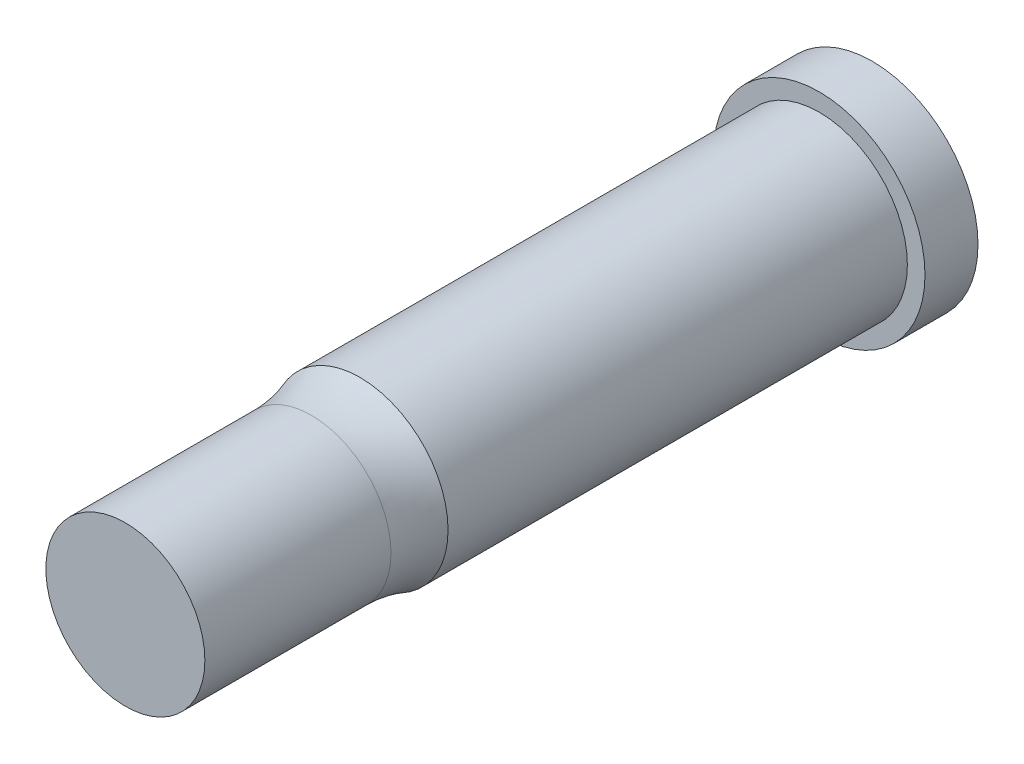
from build123d import *


with BuildPart() as part:
    # logo3_bib2 → Revolve2_Shoulder (revolve)
    with BuildSketch(Plane(origin=(0, 0, 0), x_dir=(1, 0, 0), z_dir=(0, 1, 0)), mode=Mode.PRIVATE) as revolve2_shoulder_sk:
        with BuildLine():
            Line((-7.9375, 0), (-9.525, 0))
            Line((-9.525, 0), (-9.525, 4.7752))
            Line((-9.525, 4.7752), (0, 4.7752))
            Line((0, 4.7752), (0, -62.5101366))
            Line((0, -62.5101366), (-7.1628, -62.5101366))
            Line((-7.1628, -62.5101366), (-7.1628, -45.745084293))
            ThreePointArc((-7.1628, -45.745084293), (-7.357974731, -43.527124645), (-7.9375, -41.3773366))
            Line((-7.9375, -41.3773366), (-7.9375, 0))
        make_face()
    revolve(revolve2_shoulder_sk.sketch.rotate(Axis((0, 0, 43.517168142), (0, 0, -1)), 180), axis=Axis((0, 0, 43.517168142), (0, 0, -1)))


solid = part.part
